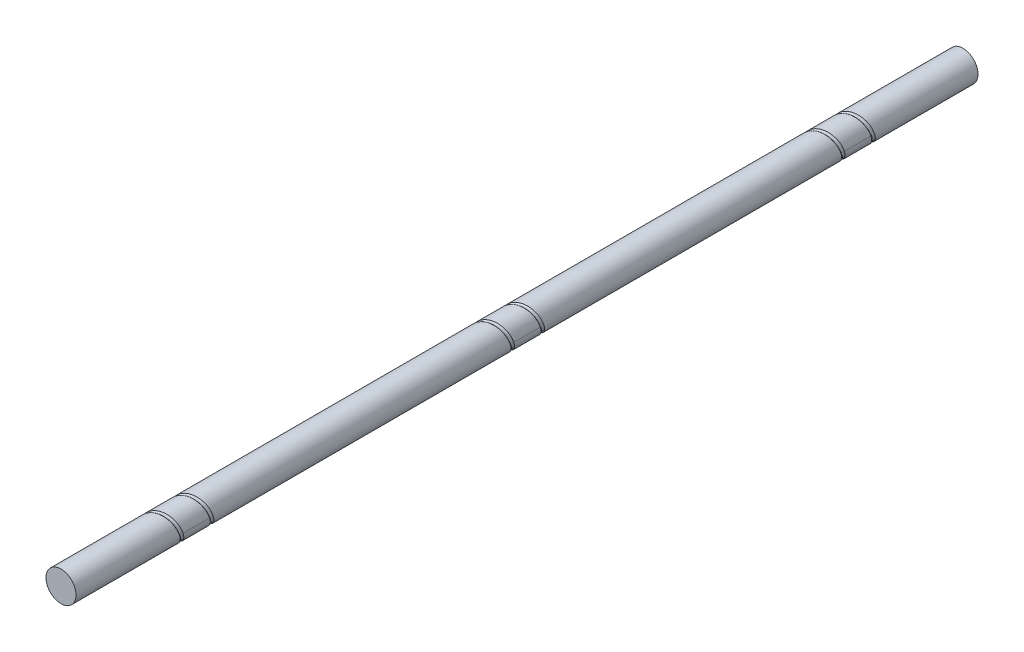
from build123d import *

# Parameters (mm, degrees)
SKETCH1_R              = 25
BOSS_EXTRUDE1_DEPTH    = 1500
CUT_SWEEP1_PITCH       = 50
CUT_SWEEP1_HEIGHT      = 100
CUT_SWEEP1_RADIUS      = 27.646
CUT_SWEEP1_START_ANGLE = -180
SKETCH3_R              = 3.969
LPATTERN1_COUNT        = 3
LPATTERN1_PITCH        = 550


with BuildPart() as part:
    # Sketch1 → Boss-Extrude1 (new body)
    with BuildSketch(Plane.XY):
        Circle(SKETCH1_R)
    extrude(amount=BOSS_EXTRUDE1_DEPTH)

    # Cut-Sweep1: sweep along a helix
    with BuildLine() as cut_sweep1_path:
        add(Helix(CUT_SWEEP1_PITCH, CUT_SWEEP1_HEIGHT, CUT_SWEEP1_RADIUS, center=(0, 0, 150), direction=(0, 0, 1), mode=Mode.PRIVATE).rotate(Axis((0, 0, 150), (0, 0, 1)), CUT_SWEEP1_START_ANGLE))
    # Sketch3 → Cut-Sweep1 (sweep, cut)
    with BuildSketch(Plane(origin=(0, 0, 0), x_dir=(1, 0, 0), z_dir=(0, 1, 0))):
        with Locations((-27.646, -150)):
            Circle(SKETCH3_R)
    cut_sweep1 = sweep(path=cut_sweep1_path.line, is_frenet=True, mode=Mode.SUBTRACT)

    # LPattern1: Cut-Sweep1 ×3
    with Locations(*[(0, 0, i * LPATTERN1_PITCH) for i in range(1, LPATTERN1_COUNT)]):
        add(cut_sweep1, mode=Mode.SUBTRACT)


solid = part.part
